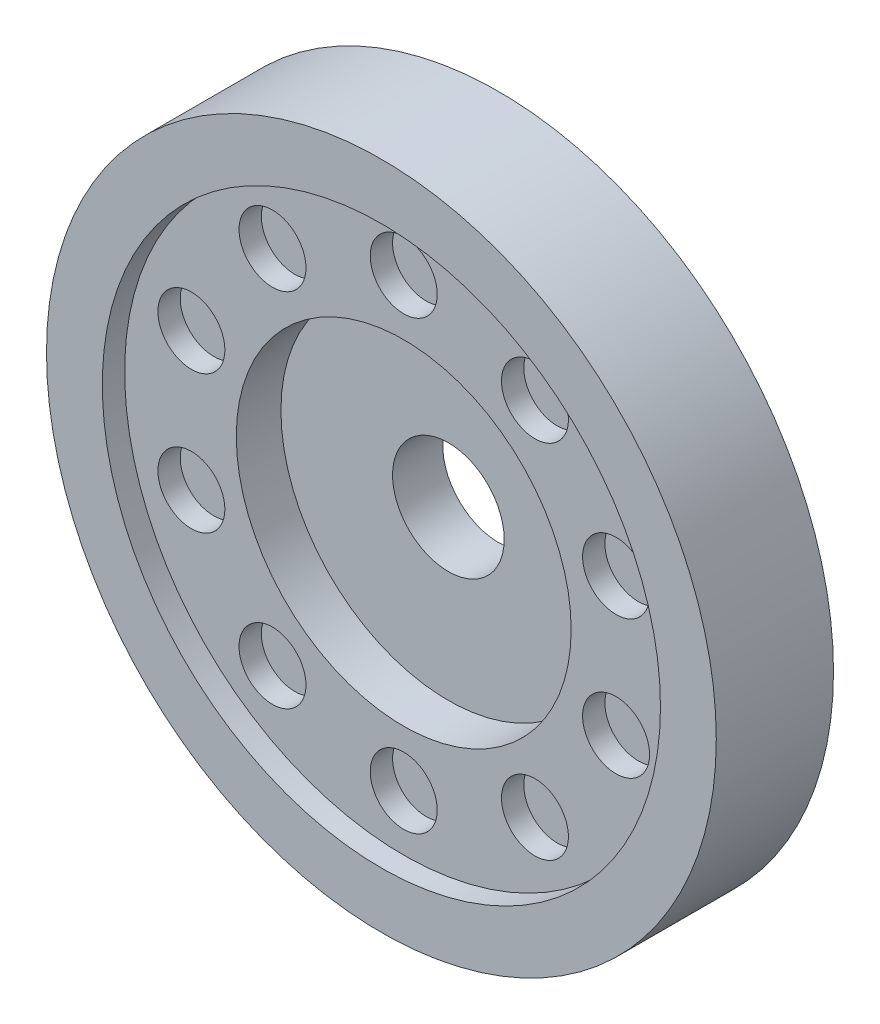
ISO-10303-21;
HEADER;
FILE_DESCRIPTION(('STEP AP214'),'2;1');
FILE_NAME('part.step','',(''),(''),'','','');
FILE_SCHEMA(('AUTOMOTIVE_DESIGN { 1 0 10303 214 1 1 1 1 }'));
ENDSEC;
DATA;
#1=APPLICATION_CONTEXT('core data for automotive mechanical design processes');
#2=APPLICATION_PROTOCOL_DEFINITION('international standard','automotive_design',2000,#1);
#3=PRODUCT_CONTEXT('',#1,'mechanical');
#4=PRODUCT('Part','Part','',(#3));
#5=PRODUCT_RELATED_PRODUCT_CATEGORY('part','',(#4));
#6=PRODUCT_DEFINITION_FORMATION('','',#4);
#7=PRODUCT_DEFINITION_CONTEXT('part definition',#1,'design');
#8=PRODUCT_DEFINITION('design','',#6,#7);
#9=PRODUCT_DEFINITION_SHAPE('','',#8);
#10=(LENGTH_UNIT() NAMED_UNIT(*) SI_UNIT(.MILLI.,.METRE.));
#11=(NAMED_UNIT(*) PLANE_ANGLE_UNIT() SI_UNIT($,.RADIAN.));
#12=(NAMED_UNIT(*) SI_UNIT($,.STERADIAN.) SOLID_ANGLE_UNIT());
#13=UNCERTAINTY_MEASURE_WITH_UNIT(LENGTH_MEASURE(1.E-05),#10,'distance_accuracy_value','');
#14=(GEOMETRIC_REPRESENTATION_CONTEXT(3) GLOBAL_UNCERTAINTY_ASSIGNED_CONTEXT((#13)) GLOBAL_UNIT_ASSIGNED_CONTEXT((#10,
#11,#12)) REPRESENTATION_CONTEXT('',''));
#15=CARTESIAN_POINT('',(0.,0.,0.));
#16=DIRECTION('',(0.,0.,1.));
#17=DIRECTION('',(1.,0.,0.));
#18=AXIS2_PLACEMENT_3D('',#15,#16,#17);
#19=CARTESIAN_POINT('',(0.,0.,66.675));
#20=DIRECTION('',(0.,0.,-1.));
#21=DIRECTION('',(-1.,0.,0.));
#22=AXIS2_PLACEMENT_3D('',#19,#20,#21);
#23=CYLINDRICAL_SURFACE('',#22,381.);
#24=CARTESIAN_POINT('',(0.,0.,66.675));
#25=DIRECTION('',(0.,0.,1.));
#26=DIRECTION('',(1.,0.,0.));
#27=AXIS2_PLACEMENT_3D('',#24,#25,#26);
#28=CIRCLE('',#27,381.);
#29=CARTESIAN_POINT('',(381.,0.,66.675));
#30=VERTEX_POINT('',#29);
#31=EDGE_CURVE('E10',#30,#30,#28,.T.);
#32=ORIENTED_EDGE('',*,*,#31,.F.);
#33=EDGE_LOOP('',(#32));
#34=FACE_BOUND('',#33,.T.);
#35=CARTESIAN_POINT('',(0.,0.,-66.675));
#36=DIRECTION('',(0.,0.,1.));
#37=DIRECTION('',(1.,0.,0.));
#38=AXIS2_PLACEMENT_3D('',#35,#36,#37);
#39=CIRCLE('',#38,381.);
#40=CARTESIAN_POINT('',(381.,0.,-66.675));
#41=VERTEX_POINT('',#40);
#42=EDGE_CURVE('E33',#41,#41,#39,.T.);
#43=ORIENTED_EDGE('',*,*,#42,.T.);
#44=EDGE_LOOP('',(#43));
#45=FACE_BOUND('',#44,.T.);
#46=ADVANCED_FACE('F30',(#34,#45),#23,.T.);
#47=CARTESIAN_POINT('',(0.,0.,66.675));
#48=DIRECTION('',(0.,0.,1.));
#49=DIRECTION('',(1.,0.,0.));
#50=AXIS2_PLACEMENT_3D('',#47,#48,#49);
#51=PLANE('',#50);
#52=CARTESIAN_POINT('',(0.,0.,66.675));
#53=DIRECTION('',(0.,0.,1.));
#54=DIRECTION('',(1.,0.,0.));
#55=AXIS2_PLACEMENT_3D('',#52,#53,#54);
#56=CIRCLE('',#55,317.5);
#57=CARTESIAN_POINT('',(317.5,0.,66.675));
#58=VERTEX_POINT('',#57);
#59=EDGE_CURVE('E42',#58,#58,#56,.T.);
#60=ORIENTED_EDGE('',*,*,#59,.F.);
#61=EDGE_LOOP('',(#60));
#62=FACE_BOUND('',#61,.T.);
#63=ORIENTED_EDGE('',*,*,#31,.T.);
#64=EDGE_LOOP('',(#63));
#65=FACE_BOUND('',#64,.T.);
#66=ADVANCED_FACE('F175',(#62,#65),#51,.T.);
#67=CARTESIAN_POINT('',(0.,0.,-66.675));
#68=DIRECTION('',(0.,0.,1.));
#69=DIRECTION('',(1.,0.,0.));
#70=AXIS2_PLACEMENT_3D('',#67,#68,#69);
#71=PLANE('',#70);
#72=CARTESIAN_POINT('',(0.,0.,-66.675));
#73=DIRECTION('',(0.,0.,1.));
#74=DIRECTION('',(1.,0.,0.));
#75=AXIS2_PLACEMENT_3D('',#72,#73,#74);
#76=CIRCLE('',#75,63.5);
#77=CARTESIAN_POINT('',(63.5,0.,-66.675));
#78=VERTEX_POINT('',#77);
#79=EDGE_CURVE('E111',#78,#78,#76,.T.);
#80=ORIENTED_EDGE('',*,*,#79,.T.);
#81=EDGE_LOOP('',(#80));
#82=FACE_BOUND('',#81,.T.);
#83=ORIENTED_EDGE('',*,*,#42,.F.);
#84=EDGE_LOOP('',(#83));
#85=FACE_BOUND('',#84,.T.);
#86=ADVANCED_FACE('F120',(#82,#85),#71,.F.);
#87=CARTESIAN_POINT('',(0.,0.,41.275));
#88=DIRECTION('',(0.,0.,1.));
#89=DIRECTION('',(1.,0.,0.));
#90=AXIS2_PLACEMENT_3D('',#87,#88,#89);
#91=CYLINDRICAL_SURFACE('',#90,317.5);
#92=CARTESIAN_POINT('',(0.,0.,41.275));
#93=DIRECTION('',(0.,0.,1.));
#94=DIRECTION('',(1.,0.,0.));
#95=AXIS2_PLACEMENT_3D('',#92,#93,#94);
#96=CIRCLE('',#95,317.5);
#97=CARTESIAN_POINT('',(317.5,0.,41.275));
#98=VERTEX_POINT('',#97);
#99=EDGE_CURVE('E40',#98,#98,#96,.T.);
#100=ORIENTED_EDGE('',*,*,#99,.F.);
#101=EDGE_LOOP('',(#100));
#102=FACE_BOUND('',#101,.T.);
#103=ORIENTED_EDGE('',*,*,#59,.T.);
#104=EDGE_LOOP('',(#103));
#105=FACE_BOUND('',#104,.T.);
#106=ADVANCED_FACE('F146',(#102,#105),#91,.F.);
#107=CARTESIAN_POINT('',(0.,0.,41.275));
#108=DIRECTION('',(0.,0.,1.));
#109=DIRECTION('',(1.,0.,0.));
#110=AXIS2_PLACEMENT_3D('',#107,#108,#109);
#111=PLANE('',#110);
#112=CARTESIAN_POINT('',(0.,0.,41.275));
#113=DIRECTION('',(0.,0.,1.));
#114=DIRECTION('',(1.,0.,0.));
#115=AXIS2_PLACEMENT_3D('',#112,#113,#114);
#116=CIRCLE('',#115,190.5);
#117=CARTESIAN_POINT('',(190.5,0.,41.275));
#118=VERTEX_POINT('',#117);
#119=EDGE_CURVE('E108',#118,#118,#116,.T.);
#120=ORIENTED_EDGE('',*,*,#119,.F.);
#121=EDGE_LOOP('',(#120));
#122=FACE_BOUND('',#121,.T.);
#123=CARTESIAN_POINT('',(-149.297454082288,205.490316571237,41.275));
#124=DIRECTION('',(0.,0.,1.));
#125=DIRECTION('',(1.,0.,0.));
#126=AXIS2_PLACEMENT_3D('',#123,#124,#125);
#127=CIRCLE('',#126,38.1000000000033);
#128=CARTESIAN_POINT('',(-111.197454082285,205.490316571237,41.275));
#129=VERTEX_POINT('',#128);
#130=EDGE_CURVE('E102',#129,#129,#127,.T.);
#131=ORIENTED_EDGE('',*,*,#130,.F.);
#132=EDGE_LOOP('',(#131));
#133=FACE_BOUND('',#132,.T.);
#134=CARTESIAN_POINT('',(-241.568355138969,78.4903165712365,41.275));
#135=DIRECTION('',(0.,0.,1.));
#136=DIRECTION('',(1.,0.,0.));
#137=AXIS2_PLACEMENT_3D('',#134,#135,#136);
#138=CIRCLE('',#137,38.1000000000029);
#139=CARTESIAN_POINT('',(-203.468355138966,78.4903165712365,41.275));
#140=VERTEX_POINT('',#139);
#141=EDGE_CURVE('E96',#140,#140,#138,.T.);
#142=ORIENTED_EDGE('',*,*,#141,.F.);
#143=EDGE_LOOP('',(#142));
#144=FACE_BOUND('',#143,.T.);
#145=CARTESIAN_POINT('',(-241.568355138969,-78.4903165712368,41.275));
#146=DIRECTION('',(0.,0.,1.));
#147=DIRECTION('',(1.,0.,0.));
#148=AXIS2_PLACEMENT_3D('',#145,#146,#147);
#149=CIRCLE('',#148,38.1000000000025);
#150=CARTESIAN_POINT('',(-203.468355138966,-78.4903165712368,41.275));
#151=VERTEX_POINT('',#150);
#152=EDGE_CURVE('E90',#151,#151,#149,.T.);
#153=ORIENTED_EDGE('',*,*,#152,.F.);
#154=EDGE_LOOP('',(#153));
#155=FACE_BOUND('',#154,.T.);
#156=CARTESIAN_POINT('',(-149.297454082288,-205.490316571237,41.275));
#157=DIRECTION('',(0.,0.,1.));
#158=DIRECTION('',(1.,0.,0.));
#159=AXIS2_PLACEMENT_3D('',#156,#157,#158);
#160=CIRCLE('',#159,38.1000000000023);
#161=CARTESIAN_POINT('',(-111.197454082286,-205.490316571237,41.275));
#162=VERTEX_POINT('',#161);
#163=EDGE_CURVE('E84',#162,#162,#160,.T.);
#164=ORIENTED_EDGE('',*,*,#163,.F.);
#165=EDGE_LOOP('',(#164));
#166=FACE_BOUND('',#165,.T.);
#167=CARTESIAN_POINT('',(1.67826153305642E-13,-254.,41.275));
#168=DIRECTION('',(0.,0.,1.));
#169=DIRECTION('',(1.,0.,0.));
#170=AXIS2_PLACEMENT_3D('',#167,#168,#169);
#171=CIRCLE('',#170,38.1000000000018);
#172=CARTESIAN_POINT('',(38.100000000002,-254.,41.275));
#173=VERTEX_POINT('',#172);
#174=EDGE_CURVE('E78',#173,#173,#171,.T.);
#175=ORIENTED_EDGE('',*,*,#174,.F.);
#176=EDGE_LOOP('',(#175));
#177=FACE_BOUND('',#176,.T.);
#178=CARTESIAN_POINT('',(149.297454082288,-205.490316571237,41.275));
#179=DIRECTION('',(0.,0.,1.));
#180=DIRECTION('',(1.,0.,0.));
#181=AXIS2_PLACEMENT_3D('',#178,#179,#180);
#182=CIRCLE('',#181,38.1000000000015);
#183=CARTESIAN_POINT('',(187.39745408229,-205.490316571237,41.275));
#184=VERTEX_POINT('',#183);
#185=EDGE_CURVE('E72',#184,#184,#182,.T.);
#186=ORIENTED_EDGE('',*,*,#185,.F.);
#187=EDGE_LOOP('',(#186));
#188=FACE_BOUND('',#187,.T.);
#189=CARTESIAN_POINT('',(241.568355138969,-78.4903165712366,41.275));
#190=DIRECTION('',(0.,0.,1.));
#191=DIRECTION('',(1.,0.,0.));
#192=AXIS2_PLACEMENT_3D('',#189,#190,#191);
#193=CIRCLE('',#192,38.1000000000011);
#194=CARTESIAN_POINT('',(279.66835513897,-78.4903165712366,41.275));
#195=VERTEX_POINT('',#194);
#196=EDGE_CURVE('E66',#195,#195,#193,.T.);
#197=ORIENTED_EDGE('',*,*,#196,.F.);
#198=EDGE_LOOP('',(#197));
#199=FACE_BOUND('',#198,.T.);
#200=CARTESIAN_POINT('',(241.568355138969,78.4903165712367,41.275));
#201=DIRECTION('',(0.,0.,1.));
#202=DIRECTION('',(1.,0.,0.));
#203=AXIS2_PLACEMENT_3D('',#200,#201,#202);
#204=CIRCLE('',#203,38.1000000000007);
#205=CARTESIAN_POINT('',(279.66835513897,78.4903165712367,41.275));
#206=VERTEX_POINT('',#205);
#207=EDGE_CURVE('E60',#206,#206,#204,.T.);
#208=ORIENTED_EDGE('',*,*,#207,.F.);
#209=EDGE_LOOP('',(#208));
#210=FACE_BOUND('',#209,.T.);
#211=CARTESIAN_POINT('',(149.297454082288,205.490316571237,41.275));
#212=DIRECTION('',(0.,0.,1.));
#213=DIRECTION('',(1.,0.,0.));
#214=AXIS2_PLACEMENT_3D('',#211,#212,#213);
#215=CIRCLE('',#214,38.1000000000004);
#216=CARTESIAN_POINT('',(187.397454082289,205.490316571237,41.275));
#217=VERTEX_POINT('',#216);
#218=EDGE_CURVE('E54',#217,#217,#215,.T.);
#219=ORIENTED_EDGE('',*,*,#218,.F.);
#220=EDGE_LOOP('',(#219));
#221=FACE_BOUND('',#220,.T.);
#222=CARTESIAN_POINT('',(0.,254.,41.275));
#223=DIRECTION('',(0.,0.,1.));
#224=DIRECTION('',(1.,0.,0.));
#225=AXIS2_PLACEMENT_3D('',#222,#223,#224);
#226=CIRCLE('',#225,38.1);
#227=CARTESIAN_POINT('',(38.1,254.,41.275));
#228=VERTEX_POINT('',#227);
#229=EDGE_CURVE('E48',#228,#228,#226,.T.);
#230=ORIENTED_EDGE('',*,*,#229,.F.);
#231=EDGE_LOOP('',(#230));
#232=FACE_BOUND('',#231,.T.);
#233=ORIENTED_EDGE('',*,*,#99,.T.);
#234=EDGE_LOOP('',(#233));
#235=FACE_BOUND('',#234,.T.);
#236=ADVANCED_FACE('F142',(#122,#133,#144,#155,#166,#177,#188,#199,#210,#221,#232,#235),#111,.T.);
#237=CARTESIAN_POINT('',(0.,254.,15.875));
#238=DIRECTION('',(0.,0.,1.));
#239=DIRECTION('',(1.,0.,0.));
#240=AXIS2_PLACEMENT_3D('',#237,#238,#239);
#241=CYLINDRICAL_SURFACE('',#240,38.1);
#242=CARTESIAN_POINT('',(0.,254.,15.875));
#243=DIRECTION('',(0.,0.,1.));
#244=DIRECTION('',(1.,0.,0.));
#245=AXIS2_PLACEMENT_3D('',#242,#243,#244);
#246=CIRCLE('',#245,38.1);
#247=CARTESIAN_POINT('',(38.1,254.,15.875));
#248=VERTEX_POINT('',#247);
#249=EDGE_CURVE('E45',#248,#248,#246,.T.);
#250=ORIENTED_EDGE('',*,*,#249,.F.);
#251=EDGE_LOOP('',(#250));
#252=FACE_BOUND('',#251,.T.);
#253=ORIENTED_EDGE('',*,*,#229,.T.);
#254=EDGE_LOOP('',(#253));
#255=FACE_BOUND('',#254,.T.);
#256=ADVANCED_FACE('F145',(#252,#255),#241,.F.);
#257=CARTESIAN_POINT('',(0.,254.,15.875));
#258=DIRECTION('',(0.,0.,1.));
#259=DIRECTION('',(1.,0.,0.));
#260=AXIS2_PLACEMENT_3D('',#257,#258,#259);
#261=PLANE('',#260);
#262=ORIENTED_EDGE('',*,*,#249,.T.);
#263=EDGE_LOOP('',(#262));
#264=FACE_BOUND('',#263,.T.);
#265=ADVANCED_FACE('F186',(#264),#261,.T.);
#266=CARTESIAN_POINT('',(149.297454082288,205.490316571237,15.875));
#267=DIRECTION('',(0.,0.,1.));
#268=DIRECTION('',(1.,0.,0.));
#269=AXIS2_PLACEMENT_3D('',#266,#267,#268);
#270=CYLINDRICAL_SURFACE('',#269,38.1000000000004);
#271=CARTESIAN_POINT('',(149.297454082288,205.490316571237,15.875));
#272=DIRECTION('',(0.,0.,1.));
#273=DIRECTION('',(1.,0.,0.));
#274=AXIS2_PLACEMENT_3D('',#271,#272,#273);
#275=CIRCLE('',#274,38.1000000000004);
#276=CARTESIAN_POINT('',(187.397454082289,205.490316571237,15.875));
#277=VERTEX_POINT('',#276);
#278=EDGE_CURVE('E51',#277,#277,#275,.T.);
#279=ORIENTED_EDGE('',*,*,#278,.F.);
#280=EDGE_LOOP('',(#279));
#281=FACE_BOUND('',#280,.T.);
#282=ORIENTED_EDGE('',*,*,#218,.T.);
#283=EDGE_LOOP('',(#282));
#284=FACE_BOUND('',#283,.T.);
#285=ADVANCED_FACE('F190',(#281,#284),#270,.F.);
#286=CARTESIAN_POINT('',(149.297454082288,205.490316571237,15.875));
#287=DIRECTION('',(0.,0.,1.));
#288=DIRECTION('',(1.,0.,0.));
#289=AXIS2_PLACEMENT_3D('',#286,#287,#288);
#290=PLANE('',#289);
#291=ORIENTED_EDGE('',*,*,#278,.T.);
#292=EDGE_LOOP('',(#291));
#293=FACE_BOUND('',#292,.T.);
#294=ADVANCED_FACE('F194',(#293),#290,.T.);
#295=CARTESIAN_POINT('',(241.568355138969,78.4903165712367,15.875));
#296=DIRECTION('',(0.,0.,1.));
#297=DIRECTION('',(1.,0.,0.));
#298=AXIS2_PLACEMENT_3D('',#295,#296,#297);
#299=CYLINDRICAL_SURFACE('',#298,38.1000000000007);
#300=CARTESIAN_POINT('',(241.568355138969,78.4903165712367,15.875));
#301=DIRECTION('',(0.,0.,1.));
#302=DIRECTION('',(1.,0.,0.));
#303=AXIS2_PLACEMENT_3D('',#300,#301,#302);
#304=CIRCLE('',#303,38.1000000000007);
#305=CARTESIAN_POINT('',(279.66835513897,78.4903165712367,15.875));
#306=VERTEX_POINT('',#305);
#307=EDGE_CURVE('E57',#306,#306,#304,.T.);
#308=ORIENTED_EDGE('',*,*,#307,.F.);
#309=EDGE_LOOP('',(#308));
#310=FACE_BOUND('',#309,.T.);
#311=ORIENTED_EDGE('',*,*,#207,.T.);
#312=EDGE_LOOP('',(#311));
#313=FACE_BOUND('',#312,.T.);
#314=ADVANCED_FACE('F198',(#310,#313),#299,.F.);
#315=CARTESIAN_POINT('',(241.568355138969,78.4903165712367,15.875));
#316=DIRECTION('',(0.,0.,1.));
#317=DIRECTION('',(1.,0.,0.));
#318=AXIS2_PLACEMENT_3D('',#315,#316,#317);
#319=PLANE('',#318);
#320=ORIENTED_EDGE('',*,*,#307,.T.);
#321=EDGE_LOOP('',(#320));
#322=FACE_BOUND('',#321,.T.);
#323=ADVANCED_FACE('F202',(#322),#319,.T.);
#324=CARTESIAN_POINT('',(241.568355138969,-78.4903165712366,15.875));
#325=DIRECTION('',(0.,0.,1.));
#326=DIRECTION('',(1.,0.,0.));
#327=AXIS2_PLACEMENT_3D('',#324,#325,#326);
#328=CYLINDRICAL_SURFACE('',#327,38.1000000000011);
#329=CARTESIAN_POINT('',(241.568355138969,-78.4903165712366,15.875));
#330=DIRECTION('',(0.,0.,1.));
#331=DIRECTION('',(1.,0.,0.));
#332=AXIS2_PLACEMENT_3D('',#329,#330,#331);
#333=CIRCLE('',#332,38.1000000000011);
#334=CARTESIAN_POINT('',(279.66835513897,-78.4903165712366,15.875));
#335=VERTEX_POINT('',#334);
#336=EDGE_CURVE('E63',#335,#335,#333,.T.);
#337=ORIENTED_EDGE('',*,*,#336,.F.);
#338=EDGE_LOOP('',(#337));
#339=FACE_BOUND('',#338,.T.);
#340=ORIENTED_EDGE('',*,*,#196,.T.);
#341=EDGE_LOOP('',(#340));
#342=FACE_BOUND('',#341,.T.);
#343=ADVANCED_FACE('F206',(#339,#342),#328,.F.);
#344=CARTESIAN_POINT('',(241.568355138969,-78.4903165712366,15.875));
#345=DIRECTION('',(0.,0.,1.));
#346=DIRECTION('',(1.,0.,0.));
#347=AXIS2_PLACEMENT_3D('',#344,#345,#346);
#348=PLANE('',#347);
#349=ORIENTED_EDGE('',*,*,#336,.T.);
#350=EDGE_LOOP('',(#349));
#351=FACE_BOUND('',#350,.T.);
#352=ADVANCED_FACE('F210',(#351),#348,.T.);
#353=CARTESIAN_POINT('',(149.297454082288,-205.490316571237,15.875));
#354=DIRECTION('',(0.,0.,1.));
#355=DIRECTION('',(1.,0.,0.));
#356=AXIS2_PLACEMENT_3D('',#353,#354,#355);
#357=CYLINDRICAL_SURFACE('',#356,38.1000000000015);
#358=CARTESIAN_POINT('',(149.297454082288,-205.490316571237,15.875));
#359=DIRECTION('',(0.,0.,1.));
#360=DIRECTION('',(1.,0.,0.));
#361=AXIS2_PLACEMENT_3D('',#358,#359,#360);
#362=CIRCLE('',#361,38.1000000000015);
#363=CARTESIAN_POINT('',(187.39745408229,-205.490316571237,15.875));
#364=VERTEX_POINT('',#363);
#365=EDGE_CURVE('E69',#364,#364,#362,.T.);
#366=ORIENTED_EDGE('',*,*,#365,.F.);
#367=EDGE_LOOP('',(#366));
#368=FACE_BOUND('',#367,.T.);
#369=ORIENTED_EDGE('',*,*,#185,.T.);
#370=EDGE_LOOP('',(#369));
#371=FACE_BOUND('',#370,.T.);
#372=ADVANCED_FACE('F214',(#368,#371),#357,.F.);
#373=CARTESIAN_POINT('',(149.297454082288,-205.490316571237,15.875));
#374=DIRECTION('',(0.,0.,1.));
#375=DIRECTION('',(1.,0.,0.));
#376=AXIS2_PLACEMENT_3D('',#373,#374,#375);
#377=PLANE('',#376);
#378=ORIENTED_EDGE('',*,*,#365,.T.);
#379=EDGE_LOOP('',(#378));
#380=FACE_BOUND('',#379,.T.);
#381=ADVANCED_FACE('F218',(#380),#377,.T.);
#382=CARTESIAN_POINT('',(1.67826153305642E-13,-254.,15.875));
#383=DIRECTION('',(0.,0.,1.));
#384=DIRECTION('',(1.,0.,0.));
#385=AXIS2_PLACEMENT_3D('',#382,#383,#384);
#386=CYLINDRICAL_SURFACE('',#385,38.1000000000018);
#387=CARTESIAN_POINT('',(1.67826153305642E-13,-254.,15.875));
#388=DIRECTION('',(0.,0.,1.));
#389=DIRECTION('',(1.,0.,0.));
#390=AXIS2_PLACEMENT_3D('',#387,#388,#389);
#391=CIRCLE('',#390,38.1000000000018);
#392=CARTESIAN_POINT('',(38.100000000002,-254.,15.875));
#393=VERTEX_POINT('',#392);
#394=EDGE_CURVE('E75',#393,#393,#391,.T.);
#395=ORIENTED_EDGE('',*,*,#394,.F.);
#396=EDGE_LOOP('',(#395));
#397=FACE_BOUND('',#396,.T.);
#398=ORIENTED_EDGE('',*,*,#174,.T.);
#399=EDGE_LOOP('',(#398));
#400=FACE_BOUND('',#399,.T.);
#401=ADVANCED_FACE('F222',(#397,#400),#386,.F.);
#402=CARTESIAN_POINT('',(1.67826153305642E-13,-254.,15.875));
#403=DIRECTION('',(0.,0.,1.));
#404=DIRECTION('',(1.,0.,0.));
#405=AXIS2_PLACEMENT_3D('',#402,#403,#404);
#406=PLANE('',#405);
#407=ORIENTED_EDGE('',*,*,#394,.T.);
#408=EDGE_LOOP('',(#407));
#409=FACE_BOUND('',#408,.T.);
#410=ADVANCED_FACE('F226',(#409),#406,.T.);
#411=CARTESIAN_POINT('',(-149.297454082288,-205.490316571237,15.875));
#412=DIRECTION('',(0.,0.,1.));
#413=DIRECTION('',(1.,0.,0.));
#414=AXIS2_PLACEMENT_3D('',#411,#412,#413);
#415=CYLINDRICAL_SURFACE('',#414,38.1000000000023);
#416=CARTESIAN_POINT('',(-149.297454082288,-205.490316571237,15.875));
#417=DIRECTION('',(0.,0.,1.));
#418=DIRECTION('',(1.,0.,0.));
#419=AXIS2_PLACEMENT_3D('',#416,#417,#418);
#420=CIRCLE('',#419,38.1000000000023);
#421=CARTESIAN_POINT('',(-111.197454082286,-205.490316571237,15.875));
#422=VERTEX_POINT('',#421);
#423=EDGE_CURVE('E81',#422,#422,#420,.T.);
#424=ORIENTED_EDGE('',*,*,#423,.F.);
#425=EDGE_LOOP('',(#424));
#426=FACE_BOUND('',#425,.T.);
#427=ORIENTED_EDGE('',*,*,#163,.T.);
#428=EDGE_LOOP('',(#427));
#429=FACE_BOUND('',#428,.T.);
#430=ADVANCED_FACE('F230',(#426,#429),#415,.F.);
#431=CARTESIAN_POINT('',(-149.297454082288,-205.490316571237,15.875));
#432=DIRECTION('',(0.,0.,1.));
#433=DIRECTION('',(1.,0.,0.));
#434=AXIS2_PLACEMENT_3D('',#431,#432,#433);
#435=PLANE('',#434);
#436=ORIENTED_EDGE('',*,*,#423,.T.);
#437=EDGE_LOOP('',(#436));
#438=FACE_BOUND('',#437,.T.);
#439=ADVANCED_FACE('F234',(#438),#435,.T.);
#440=CARTESIAN_POINT('',(-241.568355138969,-78.4903165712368,15.875));
#441=DIRECTION('',(0.,0.,1.));
#442=DIRECTION('',(1.,0.,0.));
#443=AXIS2_PLACEMENT_3D('',#440,#441,#442);
#444=CYLINDRICAL_SURFACE('',#443,38.1000000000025);
#445=CARTESIAN_POINT('',(-241.568355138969,-78.4903165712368,15.875));
#446=DIRECTION('',(0.,0.,1.));
#447=DIRECTION('',(1.,0.,0.));
#448=AXIS2_PLACEMENT_3D('',#445,#446,#447);
#449=CIRCLE('',#448,38.1000000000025);
#450=CARTESIAN_POINT('',(-203.468355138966,-78.4903165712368,15.875));
#451=VERTEX_POINT('',#450);
#452=EDGE_CURVE('E87',#451,#451,#449,.T.);
#453=ORIENTED_EDGE('',*,*,#452,.F.);
#454=EDGE_LOOP('',(#453));
#455=FACE_BOUND('',#454,.T.);
#456=ORIENTED_EDGE('',*,*,#152,.T.);
#457=EDGE_LOOP('',(#456));
#458=FACE_BOUND('',#457,.T.);
#459=ADVANCED_FACE('F238',(#455,#458),#444,.F.);
#460=CARTESIAN_POINT('',(-241.568355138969,-78.4903165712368,15.875));
#461=DIRECTION('',(0.,0.,1.));
#462=DIRECTION('',(1.,0.,0.));
#463=AXIS2_PLACEMENT_3D('',#460,#461,#462);
#464=PLANE('',#463);
#465=ORIENTED_EDGE('',*,*,#452,.T.);
#466=EDGE_LOOP('',(#465));
#467=FACE_BOUND('',#466,.T.);
#468=ADVANCED_FACE('F242',(#467),#464,.T.);
#469=CARTESIAN_POINT('',(-241.568355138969,78.4903165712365,15.875));
#470=DIRECTION('',(0.,0.,1.));
#471=DIRECTION('',(1.,0.,0.));
#472=AXIS2_PLACEMENT_3D('',#469,#470,#471);
#473=CYLINDRICAL_SURFACE('',#472,38.1000000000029);
#474=CARTESIAN_POINT('',(-241.568355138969,78.4903165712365,15.875));
#475=DIRECTION('',(0.,0.,1.));
#476=DIRECTION('',(1.,0.,0.));
#477=AXIS2_PLACEMENT_3D('',#474,#475,#476);
#478=CIRCLE('',#477,38.1000000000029);
#479=CARTESIAN_POINT('',(-203.468355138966,78.4903165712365,15.875));
#480=VERTEX_POINT('',#479);
#481=EDGE_CURVE('E93',#480,#480,#478,.T.);
#482=ORIENTED_EDGE('',*,*,#481,.F.);
#483=EDGE_LOOP('',(#482));
#484=FACE_BOUND('',#483,.T.);
#485=ORIENTED_EDGE('',*,*,#141,.T.);
#486=EDGE_LOOP('',(#485));
#487=FACE_BOUND('',#486,.T.);
#488=ADVANCED_FACE('F246',(#484,#487),#473,.F.);
#489=CARTESIAN_POINT('',(-241.568355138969,78.4903165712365,15.875));
#490=DIRECTION('',(0.,0.,1.));
#491=DIRECTION('',(1.,0.,0.));
#492=AXIS2_PLACEMENT_3D('',#489,#490,#491);
#493=PLANE('',#492);
#494=ORIENTED_EDGE('',*,*,#481,.T.);
#495=EDGE_LOOP('',(#494));
#496=FACE_BOUND('',#495,.T.);
#497=ADVANCED_FACE('F250',(#496),#493,.T.);
#498=CARTESIAN_POINT('',(-149.297454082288,205.490316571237,15.875));
#499=DIRECTION('',(0.,0.,1.));
#500=DIRECTION('',(1.,0.,0.));
#501=AXIS2_PLACEMENT_3D('',#498,#499,#500);
#502=CYLINDRICAL_SURFACE('',#501,38.1000000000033);
#503=CARTESIAN_POINT('',(-149.297454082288,205.490316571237,15.875));
#504=DIRECTION('',(0.,0.,1.));
#505=DIRECTION('',(1.,0.,0.));
#506=AXIS2_PLACEMENT_3D('',#503,#504,#505);
#507=CIRCLE('',#506,38.1000000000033);
#508=CARTESIAN_POINT('',(-111.197454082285,205.490316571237,15.875));
#509=VERTEX_POINT('',#508);
#510=EDGE_CURVE('E99',#509,#509,#507,.T.);
#511=ORIENTED_EDGE('',*,*,#510,.F.);
#512=EDGE_LOOP('',(#511));
#513=FACE_BOUND('',#512,.T.);
#514=ORIENTED_EDGE('',*,*,#130,.T.);
#515=EDGE_LOOP('',(#514));
#516=FACE_BOUND('',#515,.T.);
#517=ADVANCED_FACE('F254',(#513,#516),#502,.F.);
#518=CARTESIAN_POINT('',(-149.297454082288,205.490316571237,15.875));
#519=DIRECTION('',(0.,0.,1.));
#520=DIRECTION('',(1.,0.,0.));
#521=AXIS2_PLACEMENT_3D('',#518,#519,#520);
#522=PLANE('',#521);
#523=ORIENTED_EDGE('',*,*,#510,.T.);
#524=EDGE_LOOP('',(#523));
#525=FACE_BOUND('',#524,.T.);
#526=ADVANCED_FACE('F138',(#525),#522,.T.);
#527=CARTESIAN_POINT('',(0.,0.,-9.525));
#528=DIRECTION('',(0.,0.,1.));
#529=DIRECTION('',(1.,0.,0.));
#530=AXIS2_PLACEMENT_3D('',#527,#528,#529);
#531=CYLINDRICAL_SURFACE('',#530,190.5);
#532=CARTESIAN_POINT('',(0.,0.,-9.525));
#533=DIRECTION('',(0.,0.,1.));
#534=DIRECTION('',(1.,0.,0.));
#535=AXIS2_PLACEMENT_3D('',#532,#533,#534);
#536=CIRCLE('',#535,190.5);
#537=CARTESIAN_POINT('',(190.5,0.,-9.525));
#538=VERTEX_POINT('',#537);
#539=EDGE_CURVE('E105',#538,#538,#536,.T.);
#540=ORIENTED_EDGE('',*,*,#539,.F.);
#541=EDGE_LOOP('',(#540));
#542=FACE_BOUND('',#541,.T.);
#543=ORIENTED_EDGE('',*,*,#119,.T.);
#544=EDGE_LOOP('',(#543));
#545=FACE_BOUND('',#544,.T.);
#546=ADVANCED_FACE('F132',(#542,#545),#531,.F.);
#547=CARTESIAN_POINT('',(0.,0.,-9.525));
#548=DIRECTION('',(0.,0.,1.));
#549=DIRECTION('',(1.,0.,0.));
#550=AXIS2_PLACEMENT_3D('',#547,#548,#549);
#551=PLANE('',#550);
#552=CARTESIAN_POINT('',(0.,0.,-9.525));
#553=DIRECTION('',(0.,0.,1.));
#554=DIRECTION('',(1.,0.,0.));
#555=AXIS2_PLACEMENT_3D('',#552,#553,#554);
#556=CIRCLE('',#555,63.5);
#557=CARTESIAN_POINT('',(63.5,0.,-9.525));
#558=VERTEX_POINT('',#557);
#559=EDGE_CURVE('E114',#558,#558,#556,.T.);
#560=ORIENTED_EDGE('',*,*,#559,.F.);
#561=EDGE_LOOP('',(#560));
#562=FACE_BOUND('',#561,.T.);
#563=ORIENTED_EDGE('',*,*,#539,.T.);
#564=EDGE_LOOP('',(#563));
#565=FACE_BOUND('',#564,.T.);
#566=ADVANCED_FACE('F126',(#562,#565),#551,.T.);
#567=CARTESIAN_POINT('',(0.,0.,-66.675));
#568=DIRECTION('',(0.,0.,1.));
#569=DIRECTION('',(1.,0.,0.));
#570=AXIS2_PLACEMENT_3D('',#567,#568,#569);
#571=CYLINDRICAL_SURFACE('',#570,63.5);
#572=ORIENTED_EDGE('',*,*,#79,.F.);
#573=EDGE_LOOP('',(#572));
#574=FACE_BOUND('',#573,.T.);
#575=ORIENTED_EDGE('',*,*,#559,.T.);
#576=EDGE_LOOP('',(#575));
#577=FACE_BOUND('',#576,.T.);
#578=ADVANCED_FACE('F123',(#574,#577),#571,.F.);
#579=CLOSED_SHELL('',(#46,#66,#86,#106,#236,#256,#265,#285,#294,#314,#323,#343,#352,#372,#381,
#401,#410,#430,#439,#459,#468,#488,#497,#517,#526,#546,#566,#578));
#580=MANIFOLD_SOLID_BREP('B2',#579);
#581=ADVANCED_BREP_SHAPE_REPRESENTATION('',(#18,#580),#14);
#582=SHAPE_DEFINITION_REPRESENTATION(#9,#581);
ENDSEC;
END-ISO-10303-21;
